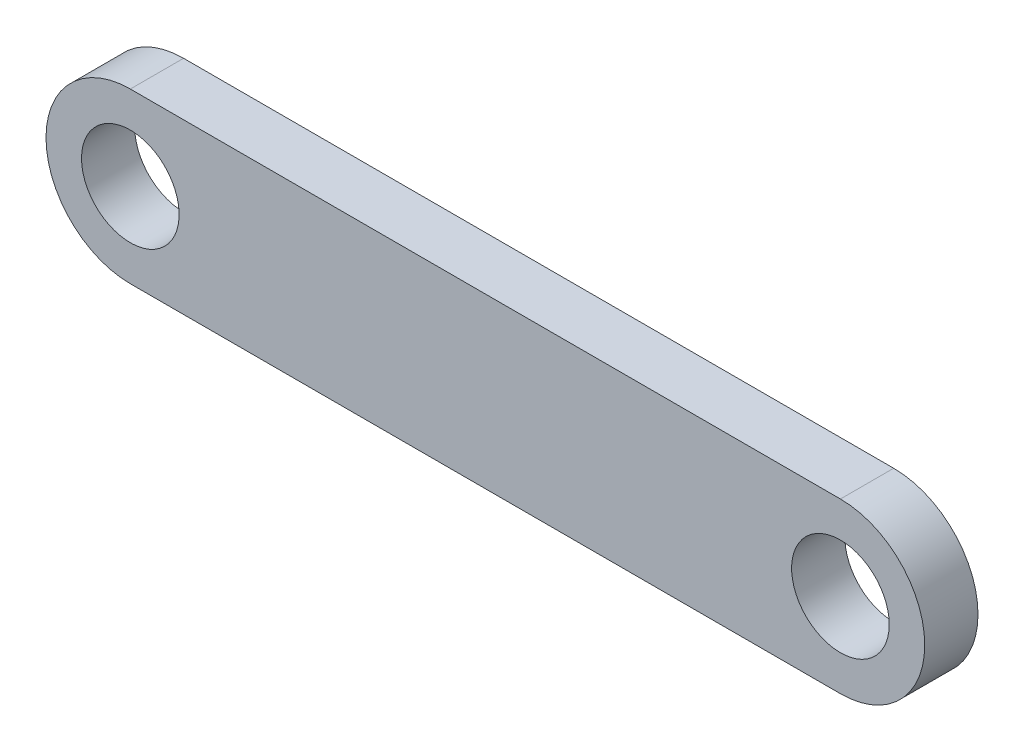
ISO-10303-21;
HEADER;
FILE_DESCRIPTION(('STEP AP214'),'2;1');
FILE_NAME('part.step','',(''),(''),'','','');
FILE_SCHEMA(('AUTOMOTIVE_DESIGN { 1 0 10303 214 1 1 1 1 }'));
ENDSEC;
DATA;
#1=APPLICATION_CONTEXT('core data for automotive mechanical design processes');
#2=APPLICATION_PROTOCOL_DEFINITION('international standard','automotive_design',2000,#1);
#3=PRODUCT_CONTEXT('',#1,'mechanical');
#4=PRODUCT('Part','Part','',(#3));
#5=PRODUCT_RELATED_PRODUCT_CATEGORY('part','',(#4));
#6=PRODUCT_DEFINITION_FORMATION('','',#4);
#7=PRODUCT_DEFINITION_CONTEXT('part definition',#1,'design');
#8=PRODUCT_DEFINITION('design','',#6,#7);
#9=PRODUCT_DEFINITION_SHAPE('','',#8);
#10=(LENGTH_UNIT() NAMED_UNIT(*) SI_UNIT(.MILLI.,.METRE.));
#11=(NAMED_UNIT(*) PLANE_ANGLE_UNIT() SI_UNIT($,.RADIAN.));
#12=(NAMED_UNIT(*) SI_UNIT($,.STERADIAN.) SOLID_ANGLE_UNIT());
#13=UNCERTAINTY_MEASURE_WITH_UNIT(LENGTH_MEASURE(1.E-05),#10,'distance_accuracy_value','');
#14=(GEOMETRIC_REPRESENTATION_CONTEXT(3) GLOBAL_UNCERTAINTY_ASSIGNED_CONTEXT((#13)) GLOBAL_UNIT_ASSIGNED_CONTEXT((#10,
#11,#12)) REPRESENTATION_CONTEXT('',''));
#15=CARTESIAN_POINT('',(0.,0.,0.));
#16=DIRECTION('',(0.,0.,1.));
#17=DIRECTION('',(1.,0.,0.));
#18=AXIS2_PLACEMENT_3D('',#15,#16,#17);
#19=CARTESIAN_POINT('',(20.,0.,3.));
#20=DIRECTION('',(0.,0.,-1.));
#21=DIRECTION('',(-1.,0.,0.));
#22=AXIS2_PLACEMENT_3D('',#19,#20,#21);
#23=PLANE('',#22);
#24=CARTESIAN_POINT('',(20.,0.,3.));
#25=DIRECTION('',(0.,0.,1.));
#26=DIRECTION('',(1.,0.,0.));
#27=AXIS2_PLACEMENT_3D('',#24,#25,#26);
#28=CIRCLE('',#27,2.75);
#29=CARTESIAN_POINT('',(22.75,0.,3.));
#30=VERTEX_POINT('',#29);
#31=EDGE_CURVE('E81',#30,#30,#28,.T.);
#32=ORIENTED_EDGE('',*,*,#31,.F.);
#33=EDGE_LOOP('',(#32));
#34=FACE_BOUND('',#33,.T.);
#35=CARTESIAN_POINT('',(20.,0.,3.));
#36=DIRECTION('',(0.,0.,1.));
#37=DIRECTION('',(-1.,0.,0.));
#38=AXIS2_PLACEMENT_3D('',#35,#36,#37);
#39=CIRCLE('',#38,4.75);
#40=CARTESIAN_POINT('',(20.,-4.75,3.));
#41=VERTEX_POINT('',#40);
#42=CARTESIAN_POINT('',(20.,4.75,3.));
#43=VERTEX_POINT('',#42);
#44=EDGE_CURVE('E66',#41,#43,#39,.T.);
#45=ORIENTED_EDGE('',*,*,#44,.T.);
#46=DIRECTION('',(-1.,0.,0.));
#47=VECTOR('',#46,1.);
#48=CARTESIAN_POINT('',(-20.,4.75,3.));
#49=LINE('',#48,#47);
#50=CARTESIAN_POINT('',(-20.,4.75,3.));
#51=VERTEX_POINT('',#50);
#52=EDGE_CURVE('E61',#43,#51,#49,.T.);
#53=ORIENTED_EDGE('',*,*,#52,.T.);
#54=CARTESIAN_POINT('',(-20.,0.,3.));
#55=DIRECTION('',(0.,0.,1.));
#56=DIRECTION('',(1.,0.,0.));
#57=AXIS2_PLACEMENT_3D('',#54,#55,#56);
#58=CIRCLE('',#57,4.75);
#59=CARTESIAN_POINT('',(-20.,-4.75,3.));
#60=VERTEX_POINT('',#59);
#61=EDGE_CURVE('E64',#51,#60,#58,.T.);
#62=ORIENTED_EDGE('',*,*,#61,.T.);
#63=DIRECTION('',(1.,0.,0.));
#64=VECTOR('',#63,1.);
#65=CARTESIAN_POINT('',(-20.,-4.75,3.));
#66=LINE('',#65,#64);
#67=EDGE_CURVE('E31',#60,#41,#66,.T.);
#68=ORIENTED_EDGE('',*,*,#67,.T.);
#69=EDGE_LOOP('',(#45,#53,#62,#68));
#70=FACE_BOUND('',#69,.T.);
#71=CARTESIAN_POINT('',(-20.,0.,3.));
#72=DIRECTION('',(0.,0.,1.));
#73=DIRECTION('',(-1.,0.,0.));
#74=AXIS2_PLACEMENT_3D('',#71,#72,#73);
#75=CIRCLE('',#74,2.75);
#76=CARTESIAN_POINT('',(-22.75,0.,3.));
#77=VERTEX_POINT('',#76);
#78=EDGE_CURVE('E96',#77,#77,#75,.T.);
#79=ORIENTED_EDGE('',*,*,#78,.F.);
#80=EDGE_LOOP('',(#79));
#81=FACE_BOUND('',#80,.T.);
#82=ADVANCED_FACE('F14',(#34,#70,#81),#23,.F.);
#83=CARTESIAN_POINT('',(20.,0.,0.));
#84=DIRECTION('',(0.,0.,-1.));
#85=DIRECTION('',(-1.,0.,0.));
#86=AXIS2_PLACEMENT_3D('',#83,#84,#85);
#87=PLANE('',#86);
#88=CARTESIAN_POINT('',(20.,0.,0.));
#89=DIRECTION('',(0.,0.,1.));
#90=DIRECTION('',(1.,0.,0.));
#91=AXIS2_PLACEMENT_3D('',#88,#89,#90);
#92=CIRCLE('',#91,2.75);
#93=CARTESIAN_POINT('',(22.75,0.,0.));
#94=VERTEX_POINT('',#93);
#95=EDGE_CURVE('E93',#94,#94,#92,.T.);
#96=ORIENTED_EDGE('',*,*,#95,.T.);
#97=EDGE_LOOP('',(#96));
#98=FACE_BOUND('',#97,.T.);
#99=CARTESIAN_POINT('',(20.,0.,0.));
#100=DIRECTION('',(0.,0.,1.));
#101=DIRECTION('',(-1.,0.,0.));
#102=AXIS2_PLACEMENT_3D('',#99,#100,#101);
#103=CIRCLE('',#102,4.75);
#104=CARTESIAN_POINT('',(20.,-4.75,0.));
#105=VERTEX_POINT('',#104);
#106=CARTESIAN_POINT('',(20.,4.75,0.));
#107=VERTEX_POINT('',#106);
#108=EDGE_CURVE('E78',#105,#107,#103,.T.);
#109=ORIENTED_EDGE('',*,*,#108,.F.);
#110=DIRECTION('',(1.,0.,0.));
#111=VECTOR('',#110,1.);
#112=CARTESIAN_POINT('',(-20.,-4.75,0.));
#113=LINE('',#112,#111);
#114=CARTESIAN_POINT('',(-20.,-4.75,0.));
#115=VERTEX_POINT('',#114);
#116=EDGE_CURVE('E54',#115,#105,#113,.T.);
#117=ORIENTED_EDGE('',*,*,#116,.F.);
#118=CARTESIAN_POINT('',(-20.,0.,0.));
#119=DIRECTION('',(0.,0.,1.));
#120=DIRECTION('',(1.,0.,0.));
#121=AXIS2_PLACEMENT_3D('',#118,#119,#120);
#122=CIRCLE('',#121,4.75);
#123=CARTESIAN_POINT('',(-20.,4.75,0.));
#124=VERTEX_POINT('',#123);
#125=EDGE_CURVE('E48',#124,#115,#122,.T.);
#126=ORIENTED_EDGE('',*,*,#125,.F.);
#127=DIRECTION('',(-1.,0.,0.));
#128=VECTOR('',#127,1.);
#129=CARTESIAN_POINT('',(-20.,4.75,0.));
#130=LINE('',#129,#128);
#131=EDGE_CURVE('E70',#107,#124,#130,.T.);
#132=ORIENTED_EDGE('',*,*,#131,.F.);
#133=EDGE_LOOP('',(#109,#117,#126,#132));
#134=FACE_BOUND('',#133,.T.);
#135=CARTESIAN_POINT('',(-20.,0.,0.));
#136=DIRECTION('',(0.,0.,1.));
#137=DIRECTION('',(-1.,0.,0.));
#138=AXIS2_PLACEMENT_3D('',#135,#136,#137);
#139=CIRCLE('',#138,2.75);
#140=CARTESIAN_POINT('',(-22.75,0.,0.));
#141=VERTEX_POINT('',#140);
#142=EDGE_CURVE('E99',#141,#141,#139,.T.);
#143=ORIENTED_EDGE('',*,*,#142,.T.);
#144=EDGE_LOOP('',(#143));
#145=FACE_BOUND('',#144,.T.);
#146=ADVANCED_FACE('F89',(#98,#134,#145),#87,.T.);
#147=CARTESIAN_POINT('',(20.,0.,3.));
#148=DIRECTION('',(0.,0.,-1.));
#149=DIRECTION('',(-1.,0.,0.));
#150=AXIS2_PLACEMENT_3D('',#147,#148,#149);
#151=CYLINDRICAL_SURFACE('',#150,4.75);
#152=ORIENTED_EDGE('',*,*,#108,.T.);
#153=DIRECTION('',(0.,0.,-1.));
#154=VECTOR('',#153,1.);
#155=CARTESIAN_POINT('',(20.,4.75,3.));
#156=LINE('',#155,#154);
#157=EDGE_CURVE('E9',#43,#107,#156,.T.);
#158=ORIENTED_EDGE('',*,*,#157,.F.);
#159=ORIENTED_EDGE('',*,*,#44,.F.);
#160=DIRECTION('',(0.,0.,-1.));
#161=VECTOR('',#160,1.);
#162=CARTESIAN_POINT('',(20.,-4.75,3.));
#163=LINE('',#162,#161);
#164=EDGE_CURVE('E74',#41,#105,#163,.T.);
#165=ORIENTED_EDGE('',*,*,#164,.T.);
#166=EDGE_LOOP('',(#152,#158,#159,#165));
#167=FACE_BOUND('',#166,.T.);
#168=ADVANCED_FACE('F16',(#167),#151,.T.);
#169=CARTESIAN_POINT('',(-20.,4.75,3.));
#170=DIRECTION('',(0.,-1.,0.));
#171=DIRECTION('',(0.,0.,-1.));
#172=AXIS2_PLACEMENT_3D('',#169,#170,#171);
#173=PLANE('',#172);
#174=ORIENTED_EDGE('',*,*,#131,.T.);
#175=DIRECTION('',(0.,0.,-1.));
#176=VECTOR('',#175,1.);
#177=CARTESIAN_POINT('',(-20.,4.75,3.));
#178=LINE('',#177,#176);
#179=EDGE_CURVE('E23',#51,#124,#178,.T.);
#180=ORIENTED_EDGE('',*,*,#179,.F.);
#181=ORIENTED_EDGE('',*,*,#52,.F.);
#182=ORIENTED_EDGE('',*,*,#157,.T.);
#183=EDGE_LOOP('',(#174,#180,#181,#182));
#184=FACE_BOUND('',#183,.T.);
#185=ADVANCED_FACE('F69',(#184),#173,.F.);
#186=CARTESIAN_POINT('',(-20.,0.,3.));
#187=DIRECTION('',(0.,0.,-1.));
#188=DIRECTION('',(-1.,0.,0.));
#189=AXIS2_PLACEMENT_3D('',#186,#187,#188);
#190=CYLINDRICAL_SURFACE('',#189,4.75);
#191=ORIENTED_EDGE('',*,*,#125,.T.);
#192=DIRECTION('',(0.,0.,-1.));
#193=VECTOR('',#192,1.);
#194=CARTESIAN_POINT('',(-20.,-4.75,3.));
#195=LINE('',#194,#193);
#196=EDGE_CURVE('E71',#60,#115,#195,.T.);
#197=ORIENTED_EDGE('',*,*,#196,.F.);
#198=ORIENTED_EDGE('',*,*,#61,.F.);
#199=ORIENTED_EDGE('',*,*,#179,.T.);
#200=EDGE_LOOP('',(#191,#197,#198,#199));
#201=FACE_BOUND('',#200,.T.);
#202=ADVANCED_FACE('F72',(#201),#190,.T.);
#203=CARTESIAN_POINT('',(-20.,-4.75,3.));
#204=DIRECTION('',(0.,1.,0.));
#205=DIRECTION('',(0.,0.,1.));
#206=AXIS2_PLACEMENT_3D('',#203,#204,#205);
#207=PLANE('',#206);
#208=ORIENTED_EDGE('',*,*,#116,.T.);
#209=ORIENTED_EDGE('',*,*,#164,.F.);
#210=ORIENTED_EDGE('',*,*,#67,.F.);
#211=ORIENTED_EDGE('',*,*,#196,.T.);
#212=EDGE_LOOP('',(#208,#209,#210,#211));
#213=FACE_BOUND('',#212,.T.);
#214=ADVANCED_FACE('F86',(#213),#207,.F.);
#215=CARTESIAN_POINT('',(20.,0.,3.));
#216=DIRECTION('',(0.,0.,-1.));
#217=DIRECTION('',(-1.,0.,0.));
#218=AXIS2_PLACEMENT_3D('',#215,#216,#217);
#219=CYLINDRICAL_SURFACE('',#218,2.75);
#220=ORIENTED_EDGE('',*,*,#31,.T.);
#221=EDGE_LOOP('',(#220));
#222=FACE_BOUND('',#221,.T.);
#223=ORIENTED_EDGE('',*,*,#95,.F.);
#224=EDGE_LOOP('',(#223));
#225=FACE_BOUND('',#224,.T.);
#226=ADVANCED_FACE('F119',(#222,#225),#219,.F.);
#227=CARTESIAN_POINT('',(-20.,0.,3.));
#228=DIRECTION('',(0.,0.,-1.));
#229=DIRECTION('',(-1.,0.,0.));
#230=AXIS2_PLACEMENT_3D('',#227,#228,#229);
#231=CYLINDRICAL_SURFACE('',#230,2.75);
#232=ORIENTED_EDGE('',*,*,#78,.T.);
#233=EDGE_LOOP('',(#232));
#234=FACE_BOUND('',#233,.T.);
#235=ORIENTED_EDGE('',*,*,#142,.F.);
#236=EDGE_LOOP('',(#235));
#237=FACE_BOUND('',#236,.T.);
#238=ADVANCED_FACE('F105',(#234,#237),#231,.F.);
#239=CLOSED_SHELL('',(#82,#146,#168,#185,#202,#214,#226,#238));
#240=MANIFOLD_SOLID_BREP('B1',#239);
#241=ADVANCED_BREP_SHAPE_REPRESENTATION('',(#18,#240),#14);
#242=SHAPE_DEFINITION_REPRESENTATION(#9,#241);
ENDSEC;
END-ISO-10303-21;
